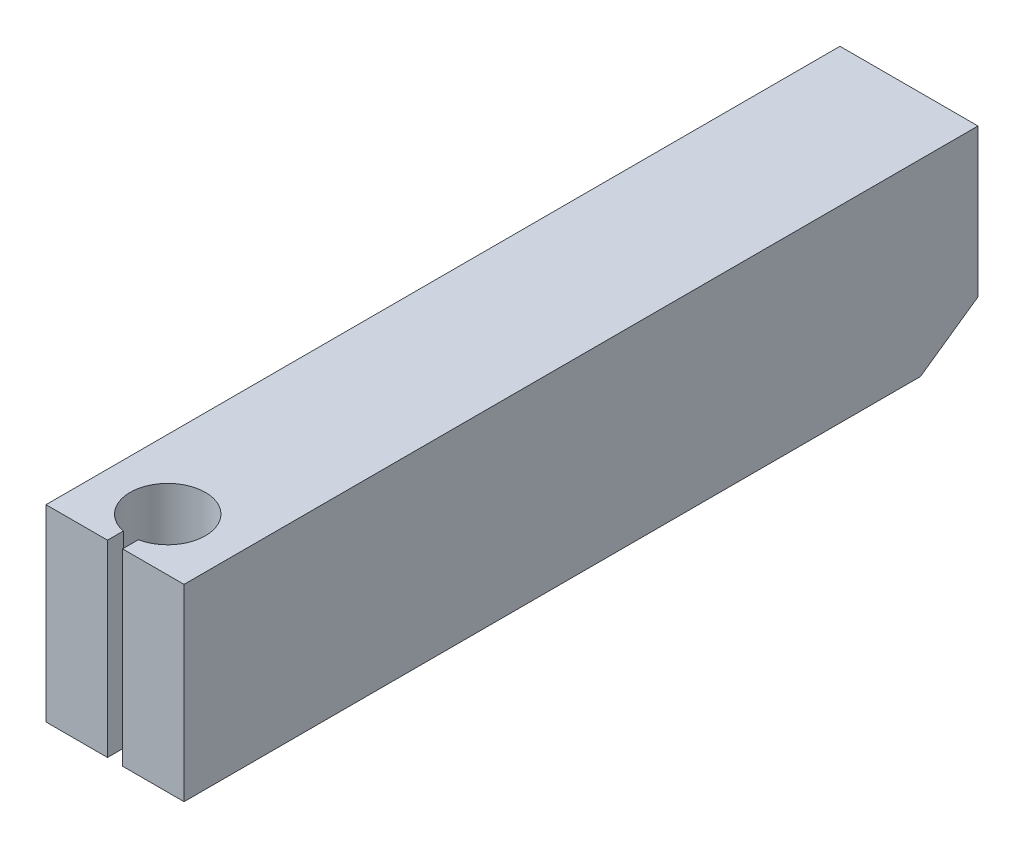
ISO-10303-21;
HEADER;
FILE_DESCRIPTION(('STEP AP214'),'2;1');
FILE_NAME('part.step','',(''),(''),'','','');
FILE_SCHEMA(('AUTOMOTIVE_DESIGN { 1 0 10303 214 1 1 1 1 }'));
ENDSEC;
DATA;
#1=APPLICATION_CONTEXT('core data for automotive mechanical design processes');
#2=APPLICATION_PROTOCOL_DEFINITION('international standard','automotive_design',2000,#1);
#3=PRODUCT_CONTEXT('',#1,'mechanical');
#4=PRODUCT('Part','Part','',(#3));
#5=PRODUCT_RELATED_PRODUCT_CATEGORY('part','',(#4));
#6=PRODUCT_DEFINITION_FORMATION('','',#4);
#7=PRODUCT_DEFINITION_CONTEXT('part definition',#1,'design');
#8=PRODUCT_DEFINITION('design','',#6,#7);
#9=PRODUCT_DEFINITION_SHAPE('','',#8);
#10=(LENGTH_UNIT() NAMED_UNIT(*) SI_UNIT(.MILLI.,.METRE.));
#11=(NAMED_UNIT(*) PLANE_ANGLE_UNIT() SI_UNIT($,.RADIAN.));
#12=(NAMED_UNIT(*) SI_UNIT($,.STERADIAN.) SOLID_ANGLE_UNIT());
#13=UNCERTAINTY_MEASURE_WITH_UNIT(LENGTH_MEASURE(1.E-05),#10,'distance_accuracy_value','');
#14=(GEOMETRIC_REPRESENTATION_CONTEXT(3) GLOBAL_UNCERTAINTY_ASSIGNED_CONTEXT((#13)) GLOBAL_UNIT_ASSIGNED_CONTEXT((#10,
#11,#12)) REPRESENTATION_CONTEXT('',''));
#15=CARTESIAN_POINT('',(0.,0.,0.));
#16=DIRECTION('',(0.,0.,1.));
#17=DIRECTION('',(1.,0.,0.));
#18=AXIS2_PLACEMENT_3D('',#15,#16,#17);
#19=CARTESIAN_POINT('',(-5.80545,3.411975,0.));
#20=DIRECTION('',(0.,0.,1.));
#21=DIRECTION('',(1.,0.,0.));
#22=AXIS2_PLACEMENT_3D('',#19,#20,#21);
#23=PLANE('',#22);
#24=DIRECTION('',(0.,1.,0.));
#25=VECTOR('',#24,1.);
#26=CARTESIAN_POINT('',(-7.43875,3.411975,0.));
#27=LINE('',#26,#25);
#28=CARTESIAN_POINT('',(-7.43875,3.411975,0.));
#29=VERTEX_POINT('',#28);
#30=CARTESIAN_POINT('',(-7.43875,8.411975,0.));
#31=VERTEX_POINT('',#30);
#32=EDGE_CURVE('E132',#29,#31,#27,.T.);
#33=ORIENTED_EDGE('',*,*,#32,.F.);
#34=DIRECTION('',(1.,0.,0.));
#35=VECTOR('',#34,1.);
#36=CARTESIAN_POINT('',(-9.47205,3.411975,0.));
#37=LINE('',#36,#35);
#38=CARTESIAN_POINT('',(-5.80545,3.411975,0.));
#39=VERTEX_POINT('',#38);
#40=EDGE_CURVE('E141',#29,#39,#37,.T.);
#41=ORIENTED_EDGE('',*,*,#40,.T.);
#42=DIRECTION('',(0.,1.,0.));
#43=VECTOR('',#42,1.);
#44=CARTESIAN_POINT('',(-5.80545,3.411975,0.));
#45=LINE('',#44,#43);
#46=CARTESIAN_POINT('',(-5.80545,8.411975,0.));
#47=VERTEX_POINT('',#46);
#48=EDGE_CURVE('E149',#39,#47,#45,.T.);
#49=ORIENTED_EDGE('',*,*,#48,.T.);
#50=DIRECTION('',(-1.,0.,0.));
#51=VECTOR('',#50,1.);
#52=CARTESIAN_POINT('',(-5.80545,8.411975,0.));
#53=LINE('',#52,#51);
#54=EDGE_CURVE('E152',#47,#31,#53,.T.);
#55=ORIENTED_EDGE('',*,*,#54,.T.);
#56=EDGE_LOOP('',(#33,#41,#49,#55));
#57=FACE_BOUND('',#56,.T.);
#58=ADVANCED_FACE('F29',(#57),#23,.T.);
#59=CARTESIAN_POINT('',(-9.47205,3.411975,-27.2893189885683));
#60=DIRECTION('',(0.,-1.,0.));
#61=DIRECTION('',(0.,0.,-1.));
#62=AXIS2_PLACEMENT_3D('',#59,#60,#61);
#63=PLANE('',#62);
#64=DIRECTION('',(0.,0.,-1.));
#65=VECTOR('',#64,1.);
#66=CARTESIAN_POINT('',(-7.43875,3.411975,-0.420204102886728));
#67=LINE('',#66,#65);
#68=CARTESIAN_POINT('',(-7.43875,3.411975,-0.420204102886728));
#69=VERTEX_POINT('',#68);
#70=EDGE_CURVE('E107',#29,#69,#67,.T.);
#71=ORIENTED_EDGE('',*,*,#70,.T.);
#72=CARTESIAN_POINT('',(-7.63875,3.411975,-1.4));
#73=DIRECTION('',(0.,1.,0.));
#74=DIRECTION('',(0.,0.,1.));
#75=AXIS2_PLACEMENT_3D('',#72,#73,#74);
#76=CIRCLE('',#75,1.);
#77=CARTESIAN_POINT('',(-7.83875,3.411975,-0.420204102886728));
#78=VERTEX_POINT('',#77);
#79=EDGE_CURVE('E123',#69,#78,#76,.T.);
#80=ORIENTED_EDGE('',*,*,#79,.T.);
#81=DIRECTION('',(0.,0.,1.));
#82=VECTOR('',#81,1.);
#83=CARTESIAN_POINT('',(-7.83875,3.411975,-0.420204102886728));
#84=LINE('',#83,#82);
#85=CARTESIAN_POINT('',(-7.83875,3.411975,0.));
#86=VERTEX_POINT('',#85);
#87=EDGE_CURVE('E102',#78,#86,#84,.T.);
#88=ORIENTED_EDGE('',*,*,#87,.T.);
#89=CARTESIAN_POINT('',(-9.47205,3.411975,0.));
#90=VERTEX_POINT('',#89);
#91=EDGE_CURVE('E146',#90,#86,#37,.T.);
#92=ORIENTED_EDGE('',*,*,#91,.F.);
#93=DIRECTION('',(0.,0.,1.));
#94=VECTOR('',#93,1.);
#95=CARTESIAN_POINT('',(-9.47205,3.411975,-27.2893189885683));
#96=LINE('',#95,#94);
#97=CARTESIAN_POINT('',(-9.47205,3.411975,-19.56125));
#98=VERTEX_POINT('',#97);
#99=EDGE_CURVE('E144',#98,#90,#96,.T.);
#100=ORIENTED_EDGE('',*,*,#99,.F.);
#101=DIRECTION('',(-1.,0.,0.));
#102=VECTOR('',#101,1.);
#103=CARTESIAN_POINT('',(-5.80545,3.411975,-19.56125));
#104=LINE('',#103,#102);
#105=CARTESIAN_POINT('',(-5.80545,3.411975,-19.56125));
#106=VERTEX_POINT('',#105);
#107=EDGE_CURVE('E138',#106,#98,#104,.T.);
#108=ORIENTED_EDGE('',*,*,#107,.F.);
#109=DIRECTION('',(0.,0.,1.));
#110=VECTOR('',#109,1.);
#111=CARTESIAN_POINT('',(-5.80545,3.411975,-27.2893189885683));
#112=LINE('',#111,#110);
#113=EDGE_CURVE('E158',#106,#39,#112,.T.);
#114=ORIENTED_EDGE('',*,*,#113,.T.);
#115=ORIENTED_EDGE('',*,*,#40,.F.);
#116=EDGE_LOOP('',(#71,#80,#88,#92,#100,#108,#114,#115));
#117=FACE_BOUND('',#116,.T.);
#118=ADVANCED_FACE('F31',(#117),#63,.T.);
#119=CARTESIAN_POINT('',(-9.47205,8.411975,-27.2893189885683));
#120=DIRECTION('',(-1.,0.,0.));
#121=DIRECTION('',(0.,0.,1.));
#122=AXIS2_PLACEMENT_3D('',#119,#120,#121);
#123=PLANE('',#122);
#124=DIRECTION('',(0.,-0.57357643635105,0.819152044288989));
#125=VECTOR('',#124,1.);
#126=CARTESIAN_POINT('',(-9.47205,4.48171706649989,-21.089));
#127=LINE('',#126,#125);
#128=CARTESIAN_POINT('',(-9.47205,4.48171706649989,-21.089));
#129=VERTEX_POINT('',#128);
#130=EDGE_CURVE('E52',#129,#98,#127,.T.);
#131=ORIENTED_EDGE('',*,*,#130,.T.);
#132=ORIENTED_EDGE('',*,*,#99,.T.);
#133=DIRECTION('',(0.,-1.,0.));
#134=VECTOR('',#133,1.);
#135=CARTESIAN_POINT('',(-9.47205,8.411975,0.));
#136=LINE('',#135,#134);
#137=CARTESIAN_POINT('',(-9.47205,8.411975,0.));
#138=VERTEX_POINT('',#137);
#139=EDGE_CURVE('E155',#138,#90,#136,.T.);
#140=ORIENTED_EDGE('',*,*,#139,.F.);
#141=DIRECTION('',(0.,0.,1.));
#142=VECTOR('',#141,1.);
#143=CARTESIAN_POINT('',(-9.47205,8.411975,-27.2893189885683));
#144=LINE('',#143,#142);
#145=CARTESIAN_POINT('',(-9.47205,8.411975,-21.089));
#146=VERTEX_POINT('',#145);
#147=EDGE_CURVE('E160',#146,#138,#144,.T.);
#148=ORIENTED_EDGE('',*,*,#147,.F.);
#149=DIRECTION('',(0.,1.,0.));
#150=VECTOR('',#149,1.);
#151=CARTESIAN_POINT('',(-9.47205,8.411975,-21.089));
#152=LINE('',#151,#150);
#153=EDGE_CURVE('E37',#129,#146,#152,.T.);
#154=ORIENTED_EDGE('',*,*,#153,.F.);
#155=EDGE_LOOP('',(#131,#132,#140,#148,#154));
#156=FACE_BOUND('',#155,.T.);
#157=ADVANCED_FACE('F187',(#156),#123,.T.);
#158=CARTESIAN_POINT('',(-5.80545,3.411975,-27.2893189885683));
#159=DIRECTION('',(1.,0.,0.));
#160=DIRECTION('',(0.,0.,-1.));
#161=AXIS2_PLACEMENT_3D('',#158,#159,#160);
#162=PLANE('',#161);
#163=ORIENTED_EDGE('',*,*,#113,.F.);
#164=DIRECTION('',(0.,-0.57357643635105,0.819152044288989));
#165=VECTOR('',#164,1.);
#166=CARTESIAN_POINT('',(-5.80545,4.48171706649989,-21.089));
#167=LINE('',#166,#165);
#168=CARTESIAN_POINT('',(-5.80545,4.48171706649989,-21.089));
#169=VERTEX_POINT('',#168);
#170=EDGE_CURVE('E136',#169,#106,#167,.T.);
#171=ORIENTED_EDGE('',*,*,#170,.F.);
#172=DIRECTION('',(0.,-1.,0.));
#173=VECTOR('',#172,1.);
#174=CARTESIAN_POINT('',(-5.80545,3.411975,-21.089));
#175=LINE('',#174,#173);
#176=CARTESIAN_POINT('',(-5.80545,8.411975,-21.089));
#177=VERTEX_POINT('',#176);
#178=EDGE_CURVE('E11',#177,#169,#175,.T.);
#179=ORIENTED_EDGE('',*,*,#178,.F.);
#180=DIRECTION('',(0.,0.,1.));
#181=VECTOR('',#180,1.);
#182=CARTESIAN_POINT('',(-5.80545,8.411975,-27.2893189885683));
#183=LINE('',#182,#181);
#184=EDGE_CURVE('E162',#177,#47,#183,.T.);
#185=ORIENTED_EDGE('',*,*,#184,.T.);
#186=ORIENTED_EDGE('',*,*,#48,.F.);
#187=EDGE_LOOP('',(#163,#171,#179,#185,#186));
#188=FACE_BOUND('',#187,.T.);
#189=ADVANCED_FACE('F172',(#188),#162,.T.);
#190=CARTESIAN_POINT('',(-3.94041162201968,3.411975,-21.089));
#191=DIRECTION('',(0.,0.,1.));
#192=DIRECTION('',(1.,0.,0.));
#193=AXIS2_PLACEMENT_3D('',#190,#191,#192);
#194=PLANE('',#193);
#195=DIRECTION('',(-1.,0.,0.));
#196=VECTOR('',#195,1.);
#197=CARTESIAN_POINT('',(-3.94041162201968,4.48171706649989,-21.089));
#198=LINE('',#197,#196);
#199=EDGE_CURVE('E131',#169,#129,#198,.T.);
#200=ORIENTED_EDGE('',*,*,#199,.T.);
#201=ORIENTED_EDGE('',*,*,#153,.T.);
#202=DIRECTION('',(1.,0.,0.));
#203=VECTOR('',#202,1.);
#204=CARTESIAN_POINT('',(-5.80545,8.411975,-21.089));
#205=LINE('',#204,#203);
#206=EDGE_CURVE('E142',#146,#177,#205,.T.);
#207=ORIENTED_EDGE('',*,*,#206,.T.);
#208=ORIENTED_EDGE('',*,*,#178,.T.);
#209=EDGE_LOOP('',(#200,#201,#207,#208));
#210=FACE_BOUND('',#209,.T.);
#211=ADVANCED_FACE('F183',(#210),#194,.F.);
#212=CARTESIAN_POINT('',(-5.80545,8.411975,-27.2893189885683));
#213=DIRECTION('',(0.,1.,0.));
#214=DIRECTION('',(0.,0.,1.));
#215=AXIS2_PLACEMENT_3D('',#212,#213,#214);
#216=PLANE('',#215);
#217=DIRECTION('',(0.,0.,-1.));
#218=VECTOR('',#217,1.);
#219=CARTESIAN_POINT('',(-7.43875,8.411975,-0.420204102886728));
#220=LINE('',#219,#218);
#221=CARTESIAN_POINT('',(-7.43875,8.411975,-0.420204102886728));
#222=VERTEX_POINT('',#221);
#223=EDGE_CURVE('E121',#31,#222,#220,.T.);
#224=ORIENTED_EDGE('',*,*,#223,.F.);
#225=ORIENTED_EDGE('',*,*,#54,.F.);
#226=ORIENTED_EDGE('',*,*,#184,.F.);
#227=ORIENTED_EDGE('',*,*,#206,.F.);
#228=ORIENTED_EDGE('',*,*,#147,.T.);
#229=CARTESIAN_POINT('',(-7.83875,8.411975,0.));
#230=VERTEX_POINT('',#229);
#231=EDGE_CURVE('E120',#230,#138,#53,.T.);
#232=ORIENTED_EDGE('',*,*,#231,.F.);
#233=DIRECTION('',(0.,0.,1.));
#234=VECTOR('',#233,1.);
#235=CARTESIAN_POINT('',(-7.83875,8.411975,-0.420204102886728));
#236=LINE('',#235,#234);
#237=CARTESIAN_POINT('',(-7.83875,8.411975,-0.420204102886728));
#238=VERTEX_POINT('',#237);
#239=EDGE_CURVE('E44',#238,#230,#236,.T.);
#240=ORIENTED_EDGE('',*,*,#239,.F.);
#241=CARTESIAN_POINT('',(-7.63875,8.411975,-1.4));
#242=DIRECTION('',(0.,1.,0.));
#243=DIRECTION('',(0.,0.,1.));
#244=AXIS2_PLACEMENT_3D('',#241,#242,#243);
#245=CIRCLE('',#244,1.);
#246=EDGE_CURVE('E110',#222,#238,#245,.T.);
#247=ORIENTED_EDGE('',*,*,#246,.F.);
#248=EDGE_LOOP('',(#224,#225,#226,#227,#228,#232,#240,#247));
#249=FACE_BOUND('',#248,.T.);
#250=ADVANCED_FACE('F118',(#249),#216,.T.);
#251=DIRECTION('',(0.,1.,0.));
#252=VECTOR('',#251,1.);
#253=CARTESIAN_POINT('',(-7.83875,3.411975,0.));
#254=LINE('',#253,#252);
#255=EDGE_CURVE('E106',#86,#230,#254,.T.);
#256=ORIENTED_EDGE('',*,*,#255,.T.);
#257=ORIENTED_EDGE('',*,*,#231,.T.);
#258=ORIENTED_EDGE('',*,*,#139,.T.);
#259=ORIENTED_EDGE('',*,*,#91,.T.);
#260=EDGE_LOOP('',(#256,#257,#258,#259));
#261=FACE_BOUND('',#260,.T.);
#262=ADVANCED_FACE('F191',(#261),#23,.T.);
#263=CARTESIAN_POINT('',(-3.94041162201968,4.48171706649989,-21.089));
#264=DIRECTION('',(0.,-0.819152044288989,-0.57357643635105));
#265=DIRECTION('',(0.,0.57357643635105,-0.819152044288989));
#266=AXIS2_PLACEMENT_3D('',#263,#264,#265);
#267=PLANE('',#266);
#268=ORIENTED_EDGE('',*,*,#170,.T.);
#269=ORIENTED_EDGE('',*,*,#107,.T.);
#270=ORIENTED_EDGE('',*,*,#130,.F.);
#271=ORIENTED_EDGE('',*,*,#199,.F.);
#272=EDGE_LOOP('',(#268,#269,#270,#271));
#273=FACE_BOUND('',#272,.T.);
#274=ADVANCED_FACE('F185',(#273),#267,.T.);
#275=CARTESIAN_POINT('',(-7.63875,3.411975,-1.4));
#276=DIRECTION('',(0.,1.,0.));
#277=DIRECTION('',(0.,0.,1.));
#278=AXIS2_PLACEMENT_3D('',#275,#276,#277);
#279=CYLINDRICAL_SURFACE('',#278,1.);
#280=ORIENTED_EDGE('',*,*,#246,.T.);
#281=DIRECTION('',(0.,1.,0.));
#282=VECTOR('',#281,1.);
#283=CARTESIAN_POINT('',(-7.83875,3.411975,-0.420204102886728));
#284=LINE('',#283,#282);
#285=EDGE_CURVE('E98',#78,#238,#284,.T.);
#286=ORIENTED_EDGE('',*,*,#285,.F.);
#287=ORIENTED_EDGE('',*,*,#79,.F.);
#288=DIRECTION('',(0.,1.,0.));
#289=VECTOR('',#288,1.);
#290=CARTESIAN_POINT('',(-7.43875,3.411975,-0.420204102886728));
#291=LINE('',#290,#289);
#292=EDGE_CURVE('E112',#69,#222,#291,.T.);
#293=ORIENTED_EDGE('',*,*,#292,.T.);
#294=EDGE_LOOP('',(#280,#286,#287,#293));
#295=FACE_BOUND('',#294,.T.);
#296=ADVANCED_FACE('F111',(#295),#279,.F.);
#297=CARTESIAN_POINT('',(-7.43875,3.411975,-0.420204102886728));
#298=DIRECTION('',(1.,0.,0.));
#299=DIRECTION('',(0.,0.,-1.));
#300=AXIS2_PLACEMENT_3D('',#297,#298,#299);
#301=PLANE('',#300);
#302=ORIENTED_EDGE('',*,*,#223,.T.);
#303=ORIENTED_EDGE('',*,*,#292,.F.);
#304=ORIENTED_EDGE('',*,*,#70,.F.);
#305=ORIENTED_EDGE('',*,*,#32,.T.);
#306=EDGE_LOOP('',(#302,#303,#304,#305));
#307=FACE_BOUND('',#306,.T.);
#308=ADVANCED_FACE('F179',(#307),#301,.F.);
#309=CARTESIAN_POINT('',(-7.83875,3.411975,-0.420204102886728));
#310=DIRECTION('',(-1.,0.,0.));
#311=DIRECTION('',(0.,0.,1.));
#312=AXIS2_PLACEMENT_3D('',#309,#310,#311);
#313=PLANE('',#312);
#314=ORIENTED_EDGE('',*,*,#239,.T.);
#315=ORIENTED_EDGE('',*,*,#255,.F.);
#316=ORIENTED_EDGE('',*,*,#87,.F.);
#317=ORIENTED_EDGE('',*,*,#285,.T.);
#318=EDGE_LOOP('',(#314,#315,#316,#317));
#319=FACE_BOUND('',#318,.T.);
#320=ADVANCED_FACE('F100',(#319),#313,.F.);
#321=CLOSED_SHELL('',(#58,#118,#157,#189,#211,#250,#262,#274,#296,#308,#320));
#322=MANIFOLD_SOLID_BREP('B2',#321);
#323=ADVANCED_BREP_SHAPE_REPRESENTATION('',(#18,#322),#14);
#324=SHAPE_DEFINITION_REPRESENTATION(#9,#323);
ENDSEC;
END-ISO-10303-21;
